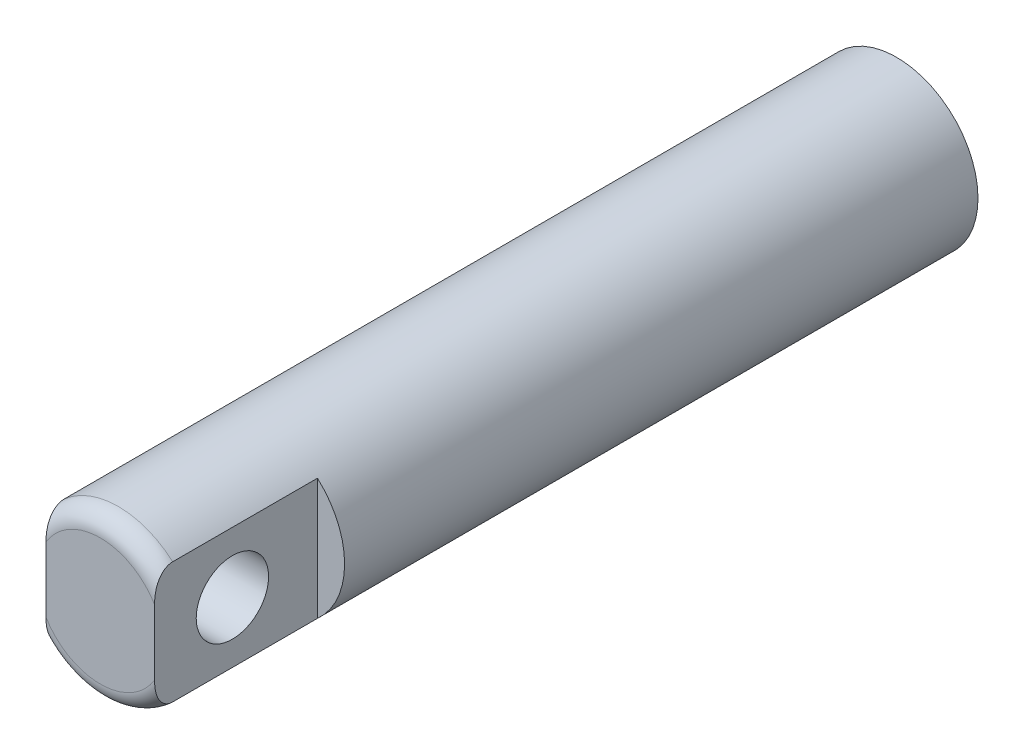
from build123d import *

# Parameters (mm, degrees)
SKETCH_1_R          = 4.5
EXTRUDE_1_DEPTH     = 35
SKETCH_2_W          = 6
SKETCH_2_H          = 6.708203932
EXTRUDE_2_DEPTH     = 9
SKETCH_3_R          = 2
CUT_EXTRUDE_1_DEPTH = 45.860896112
FILLET_1_R          = 1


with BuildPart() as part:
    # Sketch 1 → Extrude 1 (new body)
    with BuildSketch(Plane.XY):
        Circle(SKETCH_1_R)
    extrude(amount=EXTRUDE_1_DEPTH)

    # Sketch 2 → Extrude 2 (add)
    with BuildSketch(Plane.XY.offset(35)):
        with BuildLine():
            Line((-3, 3.354101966), (3, 3.354101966))
            ThreePointArc((3, 3.354101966), (0, 4.5), (-3, 3.354101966))
        make_face()
        Rectangle(SKETCH_2_W, SKETCH_2_H)
        with BuildLine():
            ThreePointArc((-3, -3.354101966), (0, -4.5), (3, -3.354101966))
            Line((3, -3.354101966), (-3, -3.354101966))
        make_face()
    extrude(amount=EXTRUDE_2_DEPTH)

    # Sketch 3 → Cut-Extrude 1 (cut, through all)
    with BuildSketch(Plane.ZY.offset(3)):
        with Locations((39.7, 0)):
            Circle(SKETCH_3_R)
    extrude(amount=-CUT_EXTRUDE_1_DEPTH, mode=Mode.SUBTRACT)

    # Fillet 1
    fillet_1_edges = [part.edges().sort_by_distance(p)[0] for p in [
        (0, 4.5, 44),
        (0, -4.5, 44),
    ]]
    fillet(fillet_1_edges, radius=FILLET_1_R)


solid = part.part
